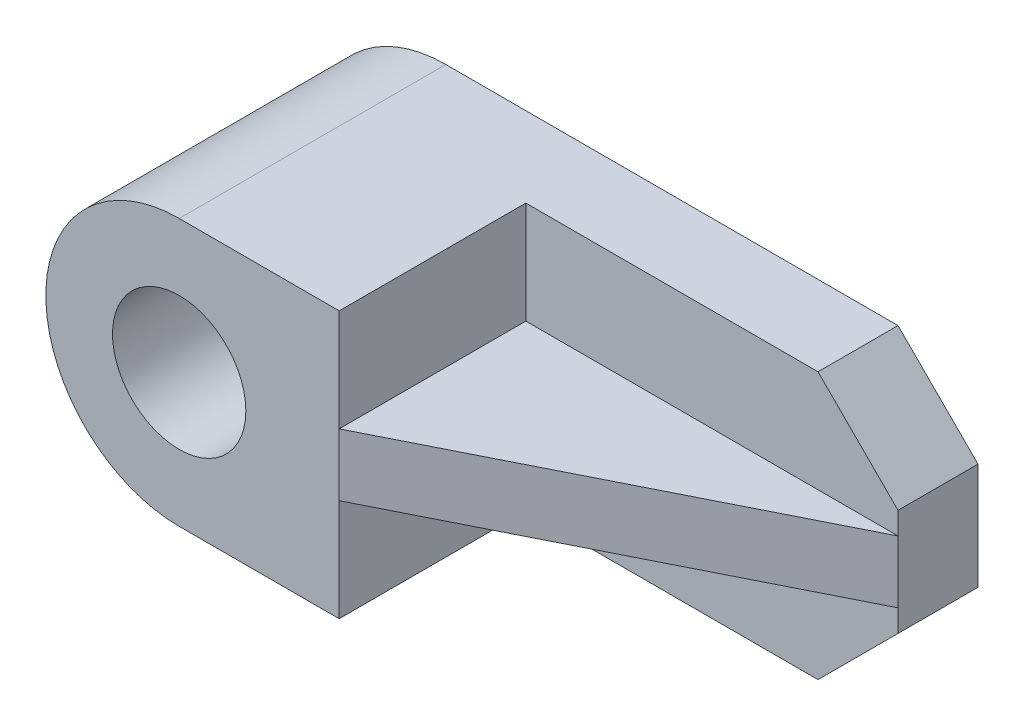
ISO-10303-21;
HEADER;
FILE_DESCRIPTION(('STEP AP214'),'2;1');
FILE_NAME('part.step','',(''),(''),'','','');
FILE_SCHEMA(('AUTOMOTIVE_DESIGN { 1 0 10303 214 1 1 1 1 }'));
ENDSEC;
DATA;
#1=APPLICATION_CONTEXT('core data for automotive mechanical design processes');
#2=APPLICATION_PROTOCOL_DEFINITION('international standard','automotive_design',2000,#1);
#3=PRODUCT_CONTEXT('',#1,'mechanical');
#4=PRODUCT('Part','Part','',(#3));
#5=PRODUCT_RELATED_PRODUCT_CATEGORY('part','',(#4));
#6=PRODUCT_DEFINITION_FORMATION('','',#4);
#7=PRODUCT_DEFINITION_CONTEXT('part definition',#1,'design');
#8=PRODUCT_DEFINITION('design','',#6,#7);
#9=PRODUCT_DEFINITION_SHAPE('','',#8);
#10=(LENGTH_UNIT() NAMED_UNIT(*) SI_UNIT(.MILLI.,.METRE.));
#11=(NAMED_UNIT(*) PLANE_ANGLE_UNIT() SI_UNIT($,.RADIAN.));
#12=(NAMED_UNIT(*) SI_UNIT($,.STERADIAN.) SOLID_ANGLE_UNIT());
#13=UNCERTAINTY_MEASURE_WITH_UNIT(LENGTH_MEASURE(1.E-05),#10,'distance_accuracy_value','');
#14=(GEOMETRIC_REPRESENTATION_CONTEXT(3) GLOBAL_UNCERTAINTY_ASSIGNED_CONTEXT((#13)) GLOBAL_UNIT_ASSIGNED_CONTEXT((#10,
#11,#12)) REPRESENTATION_CONTEXT('',''));
#15=CARTESIAN_POINT('',(0.,0.,0.));
#16=DIRECTION('',(0.,0.,1.));
#17=DIRECTION('',(1.,0.,0.));
#18=AXIS2_PLACEMENT_3D('',#15,#16,#17);
#19=CARTESIAN_POINT('',(-15.4580524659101,15.,-6.));
#20=DIRECTION('',(0.,0.,-1.));
#21=DIRECTION('',(-1.,0.,0.));
#22=AXIS2_PLACEMENT_3D('',#19,#20,#21);
#23=PLANE('',#22);
#24=DIRECTION('',(-1.,0.,0.));
#25=VECTOR('',#24,1.);
#26=CARTESIAN_POINT('',(26.4144925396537,3.5,-6.));
#27=LINE('',#26,#25);
#28=CARTESIAN_POINT('',(26.4144925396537,3.5,-6.));
#29=VERTEX_POINT('',#28);
#30=CARTESIAN_POINT('',(-15.4580524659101,3.5,-6.));
#31=VERTEX_POINT('',#30);
#32=EDGE_CURVE('E128',#29,#31,#27,.T.);
#33=ORIENTED_EDGE('',*,*,#32,.F.);
#34=DIRECTION('',(0.,-1.,0.));
#35=VECTOR('',#34,1.);
#36=CARTESIAN_POINT('',(26.4144925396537,15.,-6.));
#37=LINE('',#36,#35);
#38=CARTESIAN_POINT('',(26.4144925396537,6.,-6.));
#39=VERTEX_POINT('',#38);
#40=EDGE_CURVE('E151',#39,#29,#37,.T.);
#41=ORIENTED_EDGE('',*,*,#40,.F.);
#42=DIRECTION('',(0.707106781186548,-0.707106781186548,0.));
#43=VECTOR('',#42,1.);
#44=CARTESIAN_POINT('',(26.4144925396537,6.,-6.));
#45=LINE('',#44,#43);
#46=CARTESIAN_POINT('',(17.4144925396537,15.,-6.));
#47=VERTEX_POINT('',#46);
#48=EDGE_CURVE('E146',#47,#39,#45,.T.);
#49=ORIENTED_EDGE('',*,*,#48,.F.);
#50=DIRECTION('',(1.,0.,0.));
#51=VECTOR('',#50,1.);
#52=CARTESIAN_POINT('',(-15.4580524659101,15.,-6.));
#53=LINE('',#52,#51);
#54=CARTESIAN_POINT('',(-15.4580524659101,15.,-6.));
#55=VERTEX_POINT('',#54);
#56=EDGE_CURVE('E223',#55,#47,#53,.T.);
#57=ORIENTED_EDGE('',*,*,#56,.F.);
#58=DIRECTION('',(0.,-1.,0.));
#59=VECTOR('',#58,1.);
#60=CARTESIAN_POINT('',(-15.4580524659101,15.,-6.));
#61=LINE('',#60,#59);
#62=EDGE_CURVE('E159',#55,#31,#61,.T.);
#63=ORIENTED_EDGE('',*,*,#62,.T.);
#64=EDGE_LOOP('',(#33,#41,#49,#57,#63));
#65=FACE_BOUND('',#64,.T.);
#66=ADVANCED_FACE('F39',(#65),#23,.F.);
#67=CARTESIAN_POINT('',(-15.4580524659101,15.,15.));
#68=DIRECTION('',(-1.,0.,0.));
#69=DIRECTION('',(0.,0.,1.));
#70=AXIS2_PLACEMENT_3D('',#67,#68,#69);
#71=PLANE('',#70);
#72=DIRECTION('',(0.,0.,1.));
#73=VECTOR('',#72,1.);
#74=CARTESIAN_POINT('',(-15.4580524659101,3.5,-6.));
#75=LINE('',#74,#73);
#76=CARTESIAN_POINT('',(-15.4580524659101,3.5,15.));
#77=VERTEX_POINT('',#76);
#78=EDGE_CURVE('E129',#31,#77,#75,.T.);
#79=ORIENTED_EDGE('',*,*,#78,.F.);
#80=ORIENTED_EDGE('',*,*,#62,.F.);
#81=DIRECTION('',(0.,0.,-1.));
#82=VECTOR('',#81,1.);
#83=CARTESIAN_POINT('',(-15.4580524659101,15.,15.));
#84=LINE('',#83,#82);
#85=CARTESIAN_POINT('',(-15.4580524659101,15.,15.));
#86=VERTEX_POINT('',#85);
#87=EDGE_CURVE('E62',#86,#55,#84,.T.);
#88=ORIENTED_EDGE('',*,*,#87,.F.);
#89=DIRECTION('',(0.,-1.,0.));
#90=VECTOR('',#89,1.);
#91=CARTESIAN_POINT('',(-15.4580524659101,15.,15.));
#92=LINE('',#91,#90);
#93=EDGE_CURVE('E139',#86,#77,#92,.T.);
#94=ORIENTED_EDGE('',*,*,#93,.T.);
#95=EDGE_LOOP('',(#79,#80,#88,#94));
#96=FACE_BOUND('',#95,.T.);
#97=ADVANCED_FACE('F145',(#96),#71,.F.);
#98=CARTESIAN_POINT('',(-33.4580524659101,0.,15.));
#99=DIRECTION('',(0.,0.,-1.));
#100=DIRECTION('',(-1.,0.,0.));
#101=AXIS2_PLACEMENT_3D('',#98,#99,#100);
#102=CYLINDRICAL_SURFACE('',#101,15.);
#103=CARTESIAN_POINT('',(-33.4580524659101,0.,-15.));
#104=DIRECTION('',(0.,0.,1.));
#105=DIRECTION('',(1.,0.,0.));
#106=AXIS2_PLACEMENT_3D('',#103,#104,#105);
#107=CIRCLE('',#106,15.);
#108=CARTESIAN_POINT('',(-33.4580524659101,15.,-15.));
#109=VERTEX_POINT('',#108);
#110=CARTESIAN_POINT('',(-33.4580524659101,-15.,-15.));
#111=VERTEX_POINT('',#110);
#112=EDGE_CURVE('E164',#109,#111,#107,.T.);
#113=ORIENTED_EDGE('',*,*,#112,.T.);
#114=DIRECTION('',(0.,0.,-1.));
#115=VECTOR('',#114,1.);
#116=CARTESIAN_POINT('',(-33.4580524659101,-15.,15.));
#117=LINE('',#116,#115);
#118=CARTESIAN_POINT('',(-33.4580524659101,-15.,15.));
#119=VERTEX_POINT('',#118);
#120=EDGE_CURVE('E11',#119,#111,#117,.T.);
#121=ORIENTED_EDGE('',*,*,#120,.F.);
#122=CARTESIAN_POINT('',(-33.4580524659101,0.,15.));
#123=DIRECTION('',(0.,0.,1.));
#124=DIRECTION('',(1.,0.,0.));
#125=AXIS2_PLACEMENT_3D('',#122,#123,#124);
#126=CIRCLE('',#125,15.);
#127=CARTESIAN_POINT('',(-33.4580524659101,15.,15.));
#128=VERTEX_POINT('',#127);
#129=EDGE_CURVE('E165',#128,#119,#126,.T.);
#130=ORIENTED_EDGE('',*,*,#129,.F.);
#131=DIRECTION('',(0.,0.,-1.));
#132=VECTOR('',#131,1.);
#133=CARTESIAN_POINT('',(-33.4580524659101,15.,15.));
#134=LINE('',#133,#132);
#135=EDGE_CURVE('E173',#128,#109,#134,.T.);
#136=ORIENTED_EDGE('',*,*,#135,.T.);
#137=EDGE_LOOP('',(#113,#121,#130,#136));
#138=FACE_BOUND('',#137,.T.);
#139=ADVANCED_FACE('F41',(#138),#102,.T.);
#140=CARTESIAN_POINT('',(-33.4580524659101,-15.,15.));
#141=DIRECTION('',(0.,1.,0.));
#142=DIRECTION('',(0.,0.,1.));
#143=AXIS2_PLACEMENT_3D('',#140,#141,#142);
#144=PLANE('',#143);
#145=DIRECTION('',(1.,0.,0.));
#146=VECTOR('',#145,1.);
#147=CARTESIAN_POINT('',(-15.4580524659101,-15.,-6.));
#148=LINE('',#147,#146);
#149=CARTESIAN_POINT('',(-15.4580524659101,-15.,-6.));
#150=VERTEX_POINT('',#149);
#151=CARTESIAN_POINT('',(17.4144925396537,-15.,-6.));
#152=VERTEX_POINT('',#151);
#153=EDGE_CURVE('E154',#150,#152,#148,.T.);
#154=ORIENTED_EDGE('',*,*,#153,.F.);
#155=DIRECTION('',(0.,0.,-1.));
#156=VECTOR('',#155,1.);
#157=CARTESIAN_POINT('',(-15.4580524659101,-15.,15.));
#158=LINE('',#157,#156);
#159=CARTESIAN_POINT('',(-15.4580524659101,-15.,15.));
#160=VERTEX_POINT('',#159);
#161=EDGE_CURVE('E222',#160,#150,#158,.T.);
#162=ORIENTED_EDGE('',*,*,#161,.F.);
#163=DIRECTION('',(1.,0.,0.));
#164=VECTOR('',#163,1.);
#165=CARTESIAN_POINT('',(-33.4580524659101,-15.,15.));
#166=LINE('',#165,#164);
#167=EDGE_CURVE('E168',#119,#160,#166,.T.);
#168=ORIENTED_EDGE('',*,*,#167,.F.);
#169=ORIENTED_EDGE('',*,*,#120,.T.);
#170=DIRECTION('',(1.,0.,0.));
#171=VECTOR('',#170,1.);
#172=CARTESIAN_POINT('',(-33.4580524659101,-15.,-15.));
#173=LINE('',#172,#171);
#174=CARTESIAN_POINT('',(17.4144925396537,-15.,-15.));
#175=VERTEX_POINT('',#174);
#176=EDGE_CURVE('E176',#111,#175,#173,.T.);
#177=ORIENTED_EDGE('',*,*,#176,.T.);
#178=DIRECTION('',(0.,0.,-1.));
#179=VECTOR('',#178,1.);
#180=CARTESIAN_POINT('',(17.4144925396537,-15.,15.));
#181=LINE('',#180,#179);
#182=EDGE_CURVE('E47',#152,#175,#181,.T.);
#183=ORIENTED_EDGE('',*,*,#182,.F.);
#184=EDGE_LOOP('',(#154,#162,#168,#169,#177,#183));
#185=FACE_BOUND('',#184,.T.);
#186=ADVANCED_FACE('F205',(#185),#144,.F.);
#187=CARTESIAN_POINT('',(26.4144925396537,-6.,15.));
#188=DIRECTION('',(-0.707106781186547,0.707106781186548,0.));
#189=DIRECTION('',(-0.707106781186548,-0.707106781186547,0.));
#190=AXIS2_PLACEMENT_3D('',#187,#188,#189);
#191=PLANE('',#190);
#192=DIRECTION('',(0.,0.,-1.));
#193=VECTOR('',#192,1.);
#194=CARTESIAN_POINT('',(26.4144925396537,-6.,15.));
#195=LINE('',#194,#193);
#196=CARTESIAN_POINT('',(26.4144925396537,-6.,-6.));
#197=VERTEX_POINT('',#196);
#198=CARTESIAN_POINT('',(26.4144925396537,-6.,-15.));
#199=VERTEX_POINT('',#198);
#200=EDGE_CURVE('E195',#197,#199,#195,.T.);
#201=ORIENTED_EDGE('',*,*,#200,.F.);
#202=DIRECTION('',(-0.707106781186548,-0.707106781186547,0.));
#203=VECTOR('',#202,1.);
#204=CARTESIAN_POINT('',(26.4144925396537,-6.,-6.));
#205=LINE('',#204,#203);
#206=EDGE_CURVE('E149',#197,#152,#205,.T.);
#207=ORIENTED_EDGE('',*,*,#206,.T.);
#208=ORIENTED_EDGE('',*,*,#182,.T.);
#209=DIRECTION('',(0.707106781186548,0.707106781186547,0.));
#210=VECTOR('',#209,1.);
#211=CARTESIAN_POINT('',(26.4144925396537,-6.,-15.));
#212=LINE('',#211,#210);
#213=EDGE_CURVE('E179',#175,#199,#212,.T.);
#214=ORIENTED_EDGE('',*,*,#213,.T.);
#215=EDGE_LOOP('',(#201,#207,#208,#214));
#216=FACE_BOUND('',#215,.T.);
#217=ADVANCED_FACE('F199',(#216),#191,.F.);
#218=CARTESIAN_POINT('',(26.4144925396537,-6.,15.));
#219=DIRECTION('',(-1.,0.,0.));
#220=DIRECTION('',(0.,0.,1.));
#221=AXIS2_PLACEMENT_3D('',#218,#219,#220);
#222=PLANE('',#221);
#223=DIRECTION('',(0.,0.,-1.));
#224=VECTOR('',#223,1.);
#225=CARTESIAN_POINT('',(26.4144925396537,6.,15.));
#226=LINE('',#225,#224);
#227=CARTESIAN_POINT('',(26.4144925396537,6.,-15.));
#228=VERTEX_POINT('',#227);
#229=EDGE_CURVE('E193',#39,#228,#226,.T.);
#230=ORIENTED_EDGE('',*,*,#229,.F.);
#231=ORIENTED_EDGE('',*,*,#40,.T.);
#232=DIRECTION('',(0.,-1.,0.));
#233=VECTOR('',#232,1.);
#234=CARTESIAN_POINT('',(26.4144925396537,3.5,-6.));
#235=LINE('',#234,#233);
#236=CARTESIAN_POINT('',(26.4144925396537,-3.5,-6.));
#237=VERTEX_POINT('',#236);
#238=EDGE_CURVE('E125',#29,#237,#235,.T.);
#239=ORIENTED_EDGE('',*,*,#238,.T.);
#240=EDGE_CURVE('E158',#237,#197,#37,.T.);
#241=ORIENTED_EDGE('',*,*,#240,.T.);
#242=ORIENTED_EDGE('',*,*,#200,.T.);
#243=DIRECTION('',(0.,1.,0.));
#244=VECTOR('',#243,1.);
#245=CARTESIAN_POINT('',(26.4144925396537,-6.,-15.));
#246=LINE('',#245,#244);
#247=EDGE_CURVE('E182',#199,#228,#246,.T.);
#248=ORIENTED_EDGE('',*,*,#247,.T.);
#249=EDGE_LOOP('',(#230,#231,#239,#241,#242,#248));
#250=FACE_BOUND('',#249,.T.);
#251=ADVANCED_FACE('F214',(#250),#222,.F.);
#252=CARTESIAN_POINT('',(26.4144925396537,6.,15.));
#253=DIRECTION('',(-0.707106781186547,-0.707106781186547,0.));
#254=DIRECTION('',(0.707106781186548,-0.707106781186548,0.));
#255=AXIS2_PLACEMENT_3D('',#252,#253,#254);
#256=PLANE('',#255);
#257=DIRECTION('',(0.,0.,-1.));
#258=VECTOR('',#257,1.);
#259=CARTESIAN_POINT('',(17.4144925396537,15.,15.));
#260=LINE('',#259,#258);
#261=CARTESIAN_POINT('',(17.4144925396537,15.,-15.));
#262=VERTEX_POINT('',#261);
#263=EDGE_CURVE('E191',#47,#262,#260,.T.);
#264=ORIENTED_EDGE('',*,*,#263,.F.);
#265=ORIENTED_EDGE('',*,*,#48,.T.);
#266=ORIENTED_EDGE('',*,*,#229,.T.);
#267=DIRECTION('',(-0.707106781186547,0.707106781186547,0.));
#268=VECTOR('',#267,1.);
#269=CARTESIAN_POINT('',(26.4144925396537,6.,-15.));
#270=LINE('',#269,#268);
#271=EDGE_CURVE('E185',#228,#262,#270,.T.);
#272=ORIENTED_EDGE('',*,*,#271,.T.);
#273=EDGE_LOOP('',(#264,#265,#266,#272));
#274=FACE_BOUND('',#273,.T.);
#275=ADVANCED_FACE('F278',(#274),#256,.F.);
#276=CARTESIAN_POINT('',(-33.4580524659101,15.,15.));
#277=DIRECTION('',(0.,-1.,0.));
#278=DIRECTION('',(1.,0.,0.));
#279=AXIS2_PLACEMENT_3D('',#276,#277,#278);
#280=PLANE('',#279);
#281=DIRECTION('',(-1.,0.,0.));
#282=VECTOR('',#281,1.);
#283=CARTESIAN_POINT('',(-33.4580524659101,15.,15.));
#284=LINE('',#283,#282);
#285=EDGE_CURVE('E171',#86,#128,#284,.T.);
#286=ORIENTED_EDGE('',*,*,#285,.F.);
#287=ORIENTED_EDGE('',*,*,#87,.T.);
#288=ORIENTED_EDGE('',*,*,#56,.T.);
#289=ORIENTED_EDGE('',*,*,#263,.T.);
#290=DIRECTION('',(-1.,0.,0.));
#291=VECTOR('',#290,1.);
#292=CARTESIAN_POINT('',(-33.4580524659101,15.,-15.));
#293=LINE('',#292,#291);
#294=EDGE_CURVE('E169',#262,#109,#293,.T.);
#295=ORIENTED_EDGE('',*,*,#294,.T.);
#296=ORIENTED_EDGE('',*,*,#135,.F.);
#297=EDGE_LOOP('',(#286,#287,#288,#289,#295,#296));
#298=FACE_BOUND('',#297,.T.);
#299=ADVANCED_FACE('F273',(#298),#280,.F.);
#300=CARTESIAN_POINT('',(-33.4580524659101,0.,15.));
#301=DIRECTION('',(0.,0.,1.));
#302=DIRECTION('',(1.,0.,0.));
#303=AXIS2_PLACEMENT_3D('',#300,#301,#302);
#304=PLANE('',#303);
#305=CARTESIAN_POINT('',(-33.4580524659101,0.,15.));
#306=DIRECTION('',(0.,0.,1.));
#307=DIRECTION('',(1.,0.,0.));
#308=AXIS2_PLACEMENT_3D('',#305,#306,#307);
#309=CIRCLE('',#308,7.5);
#310=CARTESIAN_POINT('',(-25.9580524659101,0.,15.));
#311=VERTEX_POINT('',#310);
#312=EDGE_CURVE('E143',#311,#311,#309,.T.);
#313=ORIENTED_EDGE('',*,*,#312,.F.);
#314=EDGE_LOOP('',(#313));
#315=FACE_BOUND('',#314,.T.);
#316=ORIENTED_EDGE('',*,*,#93,.F.);
#317=ORIENTED_EDGE('',*,*,#285,.T.);
#318=ORIENTED_EDGE('',*,*,#129,.T.);
#319=ORIENTED_EDGE('',*,*,#167,.T.);
#320=CARTESIAN_POINT('',(-15.4580524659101,-3.5,15.));
#321=VERTEX_POINT('',#320);
#322=EDGE_CURVE('E142',#321,#160,#92,.T.);
#323=ORIENTED_EDGE('',*,*,#322,.F.);
#324=DIRECTION('',(0.,-1.,0.));
#325=VECTOR('',#324,1.);
#326=CARTESIAN_POINT('',(-15.4580524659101,3.5,15.));
#327=LINE('',#326,#325);
#328=EDGE_CURVE('E54',#77,#321,#327,.T.);
#329=ORIENTED_EDGE('',*,*,#328,.F.);
#330=EDGE_LOOP('',(#316,#317,#318,#319,#323,#329));
#331=FACE_BOUND('',#330,.T.);
#332=ADVANCED_FACE('F138',(#315,#331),#304,.T.);
#333=CARTESIAN_POINT('',(-33.4580524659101,0.,-15.));
#334=DIRECTION('',(0.,0.,1.));
#335=DIRECTION('',(1.,0.,0.));
#336=AXIS2_PLACEMENT_3D('',#333,#334,#335);
#337=PLANE('',#336);
#338=CARTESIAN_POINT('',(-33.4580524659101,0.,-15.));
#339=DIRECTION('',(0.,0.,1.));
#340=DIRECTION('',(1.,0.,0.));
#341=AXIS2_PLACEMENT_3D('',#338,#339,#340);
#342=CIRCLE('',#341,7.5);
#343=CARTESIAN_POINT('',(-25.9580524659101,0.,-15.));
#344=VERTEX_POINT('',#343);
#345=EDGE_CURVE('E225',#344,#344,#342,.T.);
#346=ORIENTED_EDGE('',*,*,#345,.T.);
#347=EDGE_LOOP('',(#346));
#348=FACE_BOUND('',#347,.T.);
#349=ORIENTED_EDGE('',*,*,#112,.F.);
#350=ORIENTED_EDGE('',*,*,#294,.F.);
#351=ORIENTED_EDGE('',*,*,#271,.F.);
#352=ORIENTED_EDGE('',*,*,#247,.F.);
#353=ORIENTED_EDGE('',*,*,#213,.F.);
#354=ORIENTED_EDGE('',*,*,#176,.F.);
#355=EDGE_LOOP('',(#349,#350,#351,#352,#353,#354));
#356=FACE_BOUND('',#355,.T.);
#357=ADVANCED_FACE('F209',(#348,#356),#337,.F.);
#358=ORIENTED_EDGE('',*,*,#240,.F.);
#359=DIRECTION('',(-1.,0.,0.));
#360=VECTOR('',#359,1.);
#361=CARTESIAN_POINT('',(26.4144925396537,-3.5,-6.));
#362=LINE('',#361,#360);
#363=CARTESIAN_POINT('',(-15.4580524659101,-3.5,-6.));
#364=VERTEX_POINT('',#363);
#365=EDGE_CURVE('E134',#237,#364,#362,.T.);
#366=ORIENTED_EDGE('',*,*,#365,.T.);
#367=EDGE_CURVE('E160',#364,#150,#61,.T.);
#368=ORIENTED_EDGE('',*,*,#367,.T.);
#369=ORIENTED_EDGE('',*,*,#153,.T.);
#370=ORIENTED_EDGE('',*,*,#206,.F.);
#371=EDGE_LOOP('',(#358,#366,#368,#369,#370));
#372=FACE_BOUND('',#371,.T.);
#373=ADVANCED_FACE('F218',(#372),#23,.F.);
#374=ORIENTED_EDGE('',*,*,#367,.F.);
#375=DIRECTION('',(0.,0.,1.));
#376=VECTOR('',#375,1.);
#377=CARTESIAN_POINT('',(-15.4580524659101,-3.5,-6.));
#378=LINE('',#377,#376);
#379=EDGE_CURVE('E238',#364,#321,#378,.T.);
#380=ORIENTED_EDGE('',*,*,#379,.T.);
#381=ORIENTED_EDGE('',*,*,#322,.T.);
#382=ORIENTED_EDGE('',*,*,#161,.T.);
#383=EDGE_LOOP('',(#374,#380,#381,#382));
#384=FACE_BOUND('',#383,.T.);
#385=ADVANCED_FACE('F241',(#384),#71,.F.);
#386=CARTESIAN_POINT('',(-33.4580524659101,0.,-15.));
#387=DIRECTION('',(0.,0.,1.));
#388=DIRECTION('',(1.,0.,0.));
#389=AXIS2_PLACEMENT_3D('',#386,#387,#388);
#390=CYLINDRICAL_SURFACE('',#389,7.5);
#391=ORIENTED_EDGE('',*,*,#345,.F.);
#392=EDGE_LOOP('',(#391));
#393=FACE_BOUND('',#392,.T.);
#394=ORIENTED_EDGE('',*,*,#312,.T.);
#395=EDGE_LOOP('',(#394));
#396=FACE_BOUND('',#395,.T.);
#397=ADVANCED_FACE('F266',(#393,#396),#390,.F.);
#398=CARTESIAN_POINT('',(-15.4580524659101,3.5,15.));
#399=DIRECTION('',(-0.448301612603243,0.,-0.893882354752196));
#400=DIRECTION('',(-0.893882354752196,0.,0.448301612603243));
#401=AXIS2_PLACEMENT_3D('',#398,#399,#400);
#402=PLANE('',#401);
#403=DIRECTION('',(0.893882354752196,0.,-0.448301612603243));
#404=VECTOR('',#403,1.);
#405=CARTESIAN_POINT('',(-15.4580524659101,-3.5,15.));
#406=LINE('',#405,#404);
#407=EDGE_CURVE('E236',#321,#237,#406,.T.);
#408=ORIENTED_EDGE('',*,*,#407,.T.);
#409=ORIENTED_EDGE('',*,*,#238,.F.);
#410=DIRECTION('',(0.893882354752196,0.,-0.448301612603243));
#411=VECTOR('',#410,1.);
#412=CARTESIAN_POINT('',(-15.4580524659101,3.5,15.));
#413=LINE('',#412,#411);
#414=EDGE_CURVE('E121',#77,#29,#413,.T.);
#415=ORIENTED_EDGE('',*,*,#414,.F.);
#416=ORIENTED_EDGE('',*,*,#328,.T.);
#417=EDGE_LOOP('',(#408,#409,#415,#416));
#418=FACE_BOUND('',#417,.T.);
#419=ADVANCED_FACE('F123',(#418),#402,.F.);
#420=CARTESIAN_POINT('',(0.,3.5,0.));
#421=DIRECTION('',(0.,-1.,0.));
#422=DIRECTION('',(0.,0.,-1.));
#423=AXIS2_PLACEMENT_3D('',#420,#421,#422);
#424=PLANE('',#423);
#425=ORIENTED_EDGE('',*,*,#78,.T.);
#426=ORIENTED_EDGE('',*,*,#414,.T.);
#427=ORIENTED_EDGE('',*,*,#32,.T.);
#428=EDGE_LOOP('',(#425,#426,#427));
#429=FACE_BOUND('',#428,.T.);
#430=ADVANCED_FACE('F132',(#429),#424,.F.);
#431=CARTESIAN_POINT('',(0.,-3.5,0.));
#432=DIRECTION('',(0.,-1.,0.));
#433=DIRECTION('',(0.,0.,-1.));
#434=AXIS2_PLACEMENT_3D('',#431,#432,#433);
#435=PLANE('',#434);
#436=ORIENTED_EDGE('',*,*,#379,.F.);
#437=ORIENTED_EDGE('',*,*,#365,.F.);
#438=ORIENTED_EDGE('',*,*,#407,.F.);
#439=EDGE_LOOP('',(#436,#437,#438));
#440=FACE_BOUND('',#439,.T.);
#441=ADVANCED_FACE('F244',(#440),#435,.T.);
#442=CLOSED_SHELL('',(#66,#97,#139,#186,#217,#251,#275,#299,#332,#357,#373,#385,#397,#419,#430,#441));
#443=MANIFOLD_SOLID_BREP('B2',#442);
#444=ADVANCED_BREP_SHAPE_REPRESENTATION('',(#18,#443),#14);
#445=SHAPE_DEFINITION_REPRESENTATION(#9,#444);
ENDSEC;
END-ISO-10303-21;
